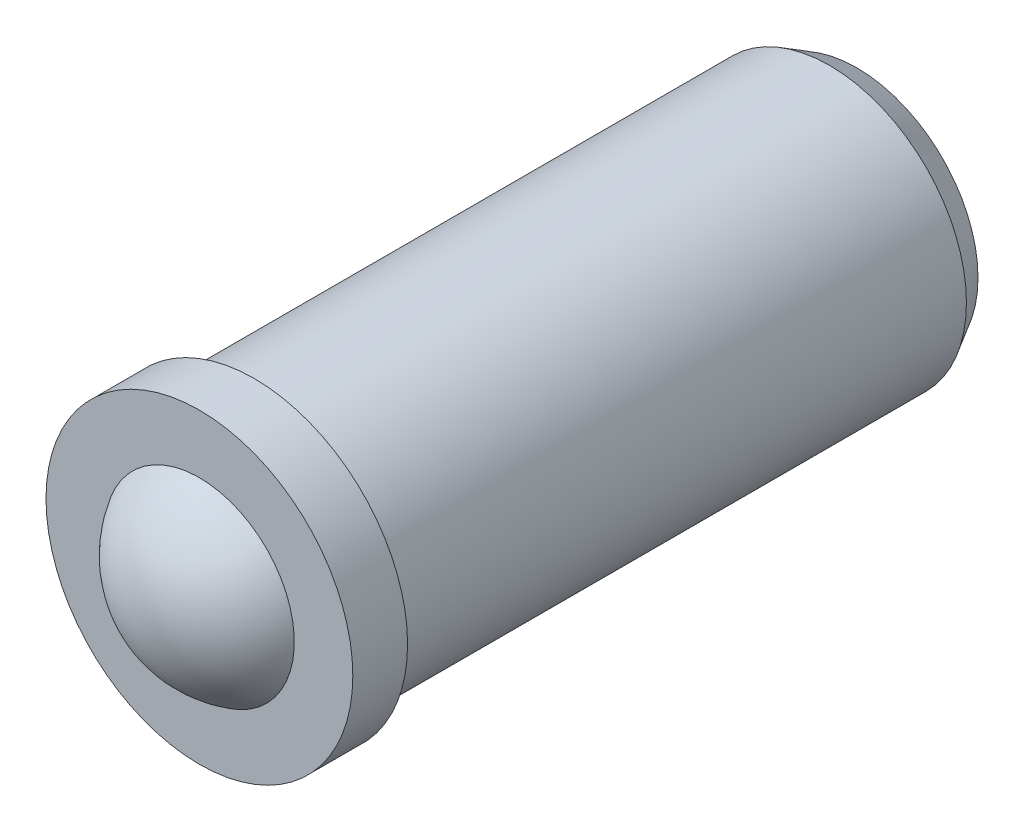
ISO-10303-21;
HEADER;
FILE_DESCRIPTION(('STEP AP214'),'2;1');
FILE_NAME('part.step','',(''),(''),'','','');
FILE_SCHEMA(('AUTOMOTIVE_DESIGN { 1 0 10303 214 1 1 1 1 }'));
ENDSEC;
DATA;
#1=APPLICATION_CONTEXT('core data for automotive mechanical design processes');
#2=APPLICATION_PROTOCOL_DEFINITION('international standard','automotive_design',2000,#1);
#3=PRODUCT_CONTEXT('',#1,'mechanical');
#4=PRODUCT('Part','Part','',(#3));
#5=PRODUCT_RELATED_PRODUCT_CATEGORY('part','',(#4));
#6=PRODUCT_DEFINITION_FORMATION('','',#4);
#7=PRODUCT_DEFINITION_CONTEXT('part definition',#1,'design');
#8=PRODUCT_DEFINITION('design','',#6,#7);
#9=PRODUCT_DEFINITION_SHAPE('','',#8);
#10=(LENGTH_UNIT() NAMED_UNIT(*) SI_UNIT(.MILLI.,.METRE.));
#11=(NAMED_UNIT(*) PLANE_ANGLE_UNIT() SI_UNIT($,.RADIAN.));
#12=(NAMED_UNIT(*) SI_UNIT($,.STERADIAN.) SOLID_ANGLE_UNIT());
#13=UNCERTAINTY_MEASURE_WITH_UNIT(LENGTH_MEASURE(1.E-05),#10,'distance_accuracy_value','');
#14=(GEOMETRIC_REPRESENTATION_CONTEXT(3) GLOBAL_UNCERTAINTY_ASSIGNED_CONTEXT((#13)) GLOBAL_UNIT_ASSIGNED_CONTEXT((#10,
#11,#12)) REPRESENTATION_CONTEXT('',''));
#15=CARTESIAN_POINT('',(0.,0.,0.));
#16=DIRECTION('',(0.,0.,1.));
#17=DIRECTION('',(1.,0.,0.));
#18=AXIS2_PLACEMENT_3D('',#15,#16,#17);
#19=CARTESIAN_POINT('',(0.,0.,0.));
#20=DIRECTION('',(-1.,0.,0.));
#21=DIRECTION('',(0.,0.,-1.));
#22=AXIS2_PLACEMENT_3D('',#19,#20,#21);
#23=SPHERICAL_SURFACE('',#22,2.);
#24=CARTESIAN_POINT('',(0.,0.,0.));
#25=DIRECTION('',(0.,0.,1.));
#26=DIRECTION('',(-1.,0.,0.));
#27=AXIS2_PLACEMENT_3D('',#24,#25,#26);
#28=SPHERICAL_SURFACE('',#27,2.);
#29=CARTESIAN_POINT('',(0.,0.,1.));
#30=DIRECTION('',(0.,0.,1.));
#31=DIRECTION('',(-1.,0.,0.));
#32=AXIS2_PLACEMENT_3D('',#29,#30,#31);
#33=CIRCLE('',#32,1.73205080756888);
#34=CARTESIAN_POINT('',(-1.73205080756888,0.,1.));
#35=VERTEX_POINT('',#34);
#36=EDGE_CURVE('E26',#35,#35,#33,.T.);
#37=ORIENTED_EDGE('',*,*,#36,.T.);
#38=EDGE_LOOP('',(#37));
#39=FACE_BOUND('',#38,.T.);
#40=ADVANCED_FACE('F12',(#39),#28,.T.);
#41=CARTESIAN_POINT('',(0.,0.,2.));
#42=DIRECTION('',(0.,0.,1.));
#43=DIRECTION('',(-1.,0.,0.));
#44=AXIS2_PLACEMENT_3D('',#41,#42,#43);
#45=CYLINDRICAL_SURFACE('',#44,2.5);
#46=CARTESIAN_POINT('',(0.,0.,-10.5));
#47=DIRECTION('',(0.,0.,1.));
#48=DIRECTION('',(1.,0.,0.));
#49=AXIS2_PLACEMENT_3D('',#46,#47,#48);
#50=CIRCLE('',#49,2.5);
#51=CARTESIAN_POINT('',(2.5,0.,-10.5));
#52=VERTEX_POINT('',#51);
#53=EDGE_CURVE('E34',#52,#52,#50,.T.);
#54=ORIENTED_EDGE('',*,*,#53,.T.);
#55=EDGE_LOOP('',(#54));
#56=FACE_BOUND('',#55,.T.);
#57=CARTESIAN_POINT('',(0.,0.,0.));
#58=DIRECTION('',(0.,0.,1.));
#59=DIRECTION('',(-1.,0.,0.));
#60=AXIS2_PLACEMENT_3D('',#57,#58,#59);
#61=CIRCLE('',#60,2.5);
#62=CARTESIAN_POINT('',(-2.5,0.,0.));
#63=VERTEX_POINT('',#62);
#64=EDGE_CURVE('E8',#63,#63,#61,.T.);
#65=ORIENTED_EDGE('',*,*,#64,.F.);
#66=EDGE_LOOP('',(#65));
#67=FACE_BOUND('',#66,.T.);
#68=ADVANCED_FACE('F38',(#56,#67),#45,.T.);
#69=CARTESIAN_POINT('',(0.,-2.5,0.));
#70=DIRECTION('',(0.,0.,1.));
#71=DIRECTION('',(-1.,0.,0.));
#72=AXIS2_PLACEMENT_3D('',#69,#70,#71);
#73=PLANE('',#72);
#74=CARTESIAN_POINT('',(0.,0.,0.));
#75=DIRECTION('',(0.,0.,1.));
#76=DIRECTION('',(-1.,0.,0.));
#77=AXIS2_PLACEMENT_3D('',#74,#75,#76);
#78=CIRCLE('',#77,2.8);
#79=CARTESIAN_POINT('',(-2.8,0.,0.));
#80=VERTEX_POINT('',#79);
#81=EDGE_CURVE('E18',#80,#80,#78,.T.);
#82=ORIENTED_EDGE('',*,*,#81,.F.);
#83=EDGE_LOOP('',(#82));
#84=FACE_BOUND('',#83,.T.);
#85=ORIENTED_EDGE('',*,*,#64,.T.);
#86=EDGE_LOOP('',(#85));
#87=FACE_BOUND('',#86,.T.);
#88=ADVANCED_FACE('F62',(#84,#87),#73,.F.);
#89=CARTESIAN_POINT('',(0.,0.,2.));
#90=DIRECTION('',(0.,0.,1.));
#91=DIRECTION('',(-1.,0.,0.));
#92=AXIS2_PLACEMENT_3D('',#89,#90,#91);
#93=CYLINDRICAL_SURFACE('',#92,2.8);
#94=CARTESIAN_POINT('',(0.,0.,1.));
#95=DIRECTION('',(0.,0.,1.));
#96=DIRECTION('',(-1.,0.,0.));
#97=AXIS2_PLACEMENT_3D('',#94,#95,#96);
#98=CIRCLE('',#97,2.8);
#99=CARTESIAN_POINT('',(-2.8,0.,1.));
#100=VERTEX_POINT('',#99);
#101=EDGE_CURVE('E22',#100,#100,#98,.T.);
#102=ORIENTED_EDGE('',*,*,#101,.F.);
#103=EDGE_LOOP('',(#102));
#104=FACE_BOUND('',#103,.T.);
#105=ORIENTED_EDGE('',*,*,#81,.T.);
#106=EDGE_LOOP('',(#105));
#107=FACE_BOUND('',#106,.T.);
#108=ADVANCED_FACE('F67',(#104,#107),#93,.T.);
#109=CARTESIAN_POINT('',(0.,-2.8,1.));
#110=DIRECTION('',(0.,0.,-1.));
#111=DIRECTION('',(1.,0.,0.));
#112=AXIS2_PLACEMENT_3D('',#109,#110,#111);
#113=PLANE('',#112);
#114=ORIENTED_EDGE('',*,*,#36,.F.);
#115=EDGE_LOOP('',(#114));
#116=FACE_BOUND('',#115,.T.);
#117=ORIENTED_EDGE('',*,*,#101,.T.);
#118=EDGE_LOOP('',(#117));
#119=FACE_BOUND('',#118,.T.);
#120=ADVANCED_FACE('F45',(#116,#119),#113,.F.);
#121=CARTESIAN_POINT('',(0.,0.,-11.));
#122=DIRECTION('',(0.,0.,1.));
#123=DIRECTION('',(1.,0.,0.));
#124=AXIS2_PLACEMENT_3D('',#121,#122,#123);
#125=CONICAL_SURFACE('',#124,2.21132486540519,0.523598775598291);
#126=ORIENTED_EDGE('',*,*,#53,.F.);
#127=EDGE_LOOP('',(#126));
#128=FACE_BOUND('',#127,.T.);
#129=CARTESIAN_POINT('',(0.,0.,-11.));
#130=DIRECTION('',(0.,0.,1.));
#131=DIRECTION('',(1.,0.,0.));
#132=AXIS2_PLACEMENT_3D('',#129,#130,#131);
#133=CIRCLE('',#132,2.21132486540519);
#134=CARTESIAN_POINT('',(2.21132486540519,0.,-11.));
#135=VERTEX_POINT('',#134);
#136=EDGE_CURVE('E31',#135,#135,#133,.T.);
#137=ORIENTED_EDGE('',*,*,#136,.T.);
#138=EDGE_LOOP('',(#137));
#139=FACE_BOUND('',#138,.T.);
#140=ADVANCED_FACE('F41',(#128,#139),#125,.T.);
#141=CARTESIAN_POINT('',(-2.5,0.,-11.));
#142=DIRECTION('',(0.,0.,1.));
#143=DIRECTION('',(1.,0.,0.));
#144=AXIS2_PLACEMENT_3D('',#141,#142,#143);
#145=PLANE('',#144);
#146=ORIENTED_EDGE('',*,*,#136,.F.);
#147=EDGE_LOOP('',(#146));
#148=FACE_BOUND('',#147,.T.);
#149=ADVANCED_FACE('F44',(#148),#145,.F.);
#150=CLOSED_SHELL('',(#40,#68,#88,#108,#120,#140,#149));
#151=MANIFOLD_SOLID_BREP('B1',#150);
#152=ADVANCED_BREP_SHAPE_REPRESENTATION('',(#18,#151),#14);
#153=SHAPE_DEFINITION_REPRESENTATION(#9,#152);
ENDSEC;
END-ISO-10303-21;
